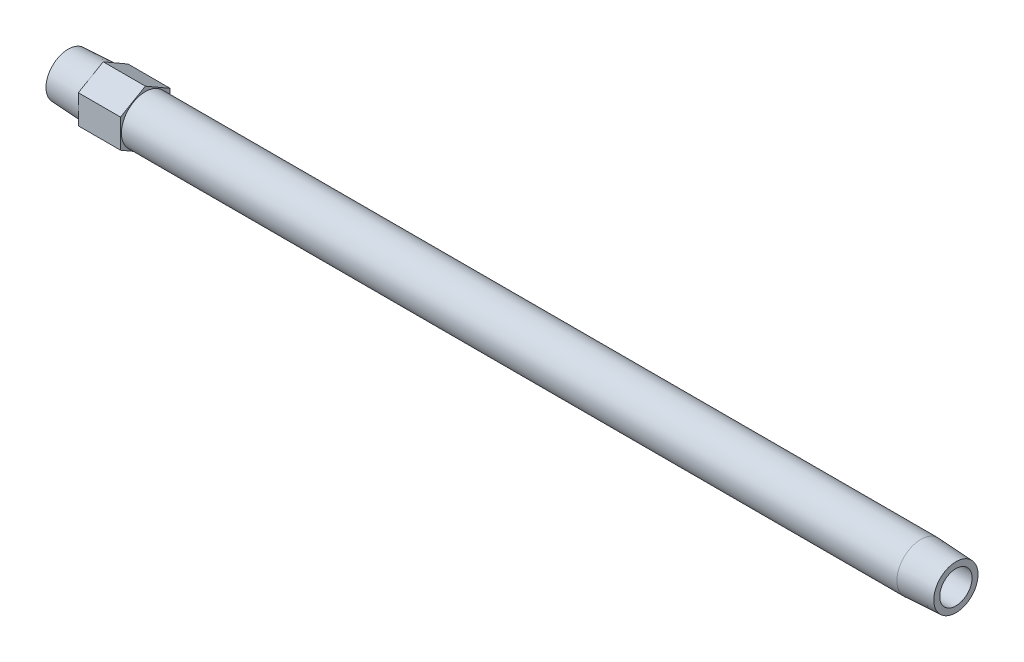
ISO-10303-21;
HEADER;
FILE_DESCRIPTION(('STEP AP214'),'2;1');
FILE_NAME('part.step','',(''),(''),'','','');
FILE_SCHEMA(('AUTOMOTIVE_DESIGN { 1 0 10303 214 1 1 1 1 }'));
ENDSEC;
DATA;
#1=APPLICATION_CONTEXT('core data for automotive mechanical design processes');
#2=APPLICATION_PROTOCOL_DEFINITION('international standard','automotive_design',2000,#1);
#3=PRODUCT_CONTEXT('',#1,'mechanical');
#4=PRODUCT('Part','Part','',(#3));
#5=PRODUCT_RELATED_PRODUCT_CATEGORY('part','',(#4));
#6=PRODUCT_DEFINITION_FORMATION('','',#4);
#7=PRODUCT_DEFINITION_CONTEXT('part definition',#1,'design');
#8=PRODUCT_DEFINITION('design','',#6,#7);
#9=PRODUCT_DEFINITION_SHAPE('','',#8);
#10=(LENGTH_UNIT() NAMED_UNIT(*) SI_UNIT(.MILLI.,.METRE.));
#11=(NAMED_UNIT(*) PLANE_ANGLE_UNIT() SI_UNIT($,.RADIAN.));
#12=(NAMED_UNIT(*) SI_UNIT($,.STERADIAN.) SOLID_ANGLE_UNIT());
#13=UNCERTAINTY_MEASURE_WITH_UNIT(LENGTH_MEASURE(1.E-05),#10,'distance_accuracy_value','');
#14=(GEOMETRIC_REPRESENTATION_CONTEXT(3) GLOBAL_UNCERTAINTY_ASSIGNED_CONTEXT((#13)) GLOBAL_UNIT_ASSIGNED_CONTEXT((#10,
#11,#12)) REPRESENTATION_CONTEXT('',''));
#15=CARTESIAN_POINT('',(0.,0.,0.));
#16=DIRECTION('',(0.,0.,1.));
#17=DIRECTION('',(1.,0.,0.));
#18=AXIS2_PLACEMENT_3D('',#15,#16,#17);
#19=CARTESIAN_POINT('',(0.,0.,-6.3321927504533));
#20=DIRECTION('',(1.,0.,0.));
#21=DIRECTION('',(0.,0.,-1.));
#22=AXIS2_PLACEMENT_3D('',#19,#20,#21);
#23=PLANE('',#22);
#24=CARTESIAN_POINT('',(0.,0.,0.));
#25=DIRECTION('',(-1.,0.,0.));
#26=DIRECTION('',(0.,0.,1.));
#27=AXIS2_PLACEMENT_3D('',#24,#25,#26);
#28=CIRCLE('',#27,6.3321927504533);
#29=CARTESIAN_POINT('',(0.,0.,6.3321927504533));
#30=VERTEX_POINT('',#29);
#31=EDGE_CURVE('E147',#30,#30,#28,.T.);
#32=ORIENTED_EDGE('',*,*,#31,.T.);
#33=EDGE_LOOP('',(#32));
#34=FACE_BOUND('',#33,.T.);
#35=CARTESIAN_POINT('',(0.,0.,0.));
#36=DIRECTION('',(1.,0.,0.));
#37=DIRECTION('',(0.,0.,1.));
#38=AXIS2_PLACEMENT_3D('',#35,#36,#37);
#39=CIRCLE('',#38,4.6228);
#40=CARTESIAN_POINT('',(0.,0.,4.6228));
#41=VERTEX_POINT('',#40);
#42=EDGE_CURVE('E159',#41,#41,#39,.T.);
#43=ORIENTED_EDGE('',*,*,#42,.T.);
#44=EDGE_LOOP('',(#43));
#45=FACE_BOUND('',#44,.T.);
#46=ADVANCED_FACE('F15',(#34,#45),#23,.F.);
#47=CARTESIAN_POINT('',(254.,0.,-6.33219275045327));
#48=DIRECTION('',(-1.,0.,0.));
#49=DIRECTION('',(0.,0.,1.));
#50=AXIS2_PLACEMENT_3D('',#47,#48,#49);
#51=PLANE('',#50);
#52=CARTESIAN_POINT('',(254.,0.,0.));
#53=DIRECTION('',(-1.,0.,0.));
#54=DIRECTION('',(0.,0.,1.));
#55=AXIS2_PLACEMENT_3D('',#52,#53,#54);
#56=CIRCLE('',#55,6.33219275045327);
#57=CARTESIAN_POINT('',(254.,0.,6.33219275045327));
#58=VERTEX_POINT('',#57);
#59=EDGE_CURVE('E150',#58,#58,#56,.T.);
#60=ORIENTED_EDGE('',*,*,#59,.F.);
#61=EDGE_LOOP('',(#60));
#62=FACE_BOUND('',#61,.T.);
#63=CARTESIAN_POINT('',(254.,0.,0.));
#64=DIRECTION('',(-1.,0.,0.));
#65=DIRECTION('',(0.,0.,1.));
#66=AXIS2_PLACEMENT_3D('',#63,#64,#65);
#67=CIRCLE('',#66,4.6228);
#68=CARTESIAN_POINT('',(254.,0.,4.6228));
#69=VERTEX_POINT('',#68);
#70=EDGE_CURVE('E156',#69,#69,#67,.F.);
#71=ORIENTED_EDGE('',*,*,#70,.F.);
#72=EDGE_LOOP('',(#71));
#73=FACE_BOUND('',#72,.T.);
#74=ADVANCED_FACE('F178',(#62,#73),#51,.F.);
#75=CARTESIAN_POINT('',(22.098,-12.3183453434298,7.112));
#76=DIRECTION('',(-1.,0.,0.));
#77=DIRECTION('',(0.,-1.,0.));
#78=AXIS2_PLACEMENT_3D('',#75,#76,#77);
#79=PLANE('',#78);
#80=DIRECTION('',(0.,0.5,-0.866025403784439));
#81=VECTOR('',#80,1.);
#82=CARTESIAN_POINT('',(22.098,-8.21223022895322,0.));
#83=LINE('',#82,#81);
#84=CARTESIAN_POINT('',(22.098,-8.21223022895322,0.));
#85=VERTEX_POINT('',#84);
#86=CARTESIAN_POINT('',(22.098,-4.10611511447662,-7.112));
#87=VERTEX_POINT('',#86);
#88=EDGE_CURVE('E103',#85,#87,#83,.T.);
#89=ORIENTED_EDGE('',*,*,#88,.T.);
#90=DIRECTION('',(0.,1.,0.));
#91=VECTOR('',#90,1.);
#92=CARTESIAN_POINT('',(22.098,-4.10611511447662,-7.112));
#93=LINE('',#92,#91);
#94=CARTESIAN_POINT('',(22.098,4.10611511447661,-7.112));
#95=VERTEX_POINT('',#94);
#96=EDGE_CURVE('E83',#87,#95,#93,.T.);
#97=ORIENTED_EDGE('',*,*,#96,.T.);
#98=DIRECTION('',(0.,0.5,0.866025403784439));
#99=VECTOR('',#98,1.);
#100=CARTESIAN_POINT('',(22.098,4.10611511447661,-7.112));
#101=LINE('',#100,#99);
#102=CARTESIAN_POINT('',(22.098,8.21223022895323,0.));
#103=VERTEX_POINT('',#102);
#104=EDGE_CURVE('E102',#95,#103,#101,.T.);
#105=ORIENTED_EDGE('',*,*,#104,.T.);
#106=DIRECTION('',(0.,-0.5,0.866025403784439));
#107=VECTOR('',#106,1.);
#108=CARTESIAN_POINT('',(22.098,8.21223022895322,0.));
#109=LINE('',#108,#107);
#110=CARTESIAN_POINT('',(22.098,4.10611511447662,7.112));
#111=VERTEX_POINT('',#110);
#112=EDGE_CURVE('E105',#103,#111,#109,.T.);
#113=ORIENTED_EDGE('',*,*,#112,.T.);
#114=DIRECTION('',(0.,-1.,0.));
#115=VECTOR('',#114,1.);
#116=CARTESIAN_POINT('',(22.098,4.10611511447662,7.112));
#117=LINE('',#116,#115);
#118=CARTESIAN_POINT('',(22.098,-4.10611511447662,7.112));
#119=VERTEX_POINT('',#118);
#120=EDGE_CURVE('E35',#111,#119,#117,.T.);
#121=ORIENTED_EDGE('',*,*,#120,.T.);
#122=DIRECTION('',(0.,-0.5,-0.866025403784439));
#123=VECTOR('',#122,1.);
#124=CARTESIAN_POINT('',(22.098,-4.10611511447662,7.112));
#125=LINE('',#124,#123);
#126=EDGE_CURVE('E30',#119,#85,#125,.T.);
#127=ORIENTED_EDGE('',*,*,#126,.T.);
#128=EDGE_LOOP('',(#89,#97,#105,#113,#121,#127));
#129=FACE_BOUND('',#128,.T.);
#130=CARTESIAN_POINT('',(22.098,0.,0.));
#131=DIRECTION('',(-1.,0.,0.));
#132=DIRECTION('',(0.,-1.,0.));
#133=AXIS2_PLACEMENT_3D('',#130,#131,#132);
#134=CIRCLE('',#133,6.858);
#135=CARTESIAN_POINT('',(22.098,-6.858,0.));
#136=VERTEX_POINT('',#135);
#137=EDGE_CURVE('E89',#136,#136,#134,.F.);
#138=ORIENTED_EDGE('',*,*,#137,.F.);
#139=EDGE_LOOP('',(#138));
#140=FACE_BOUND('',#139,.T.);
#141=ADVANCED_FACE('F124',(#129,#140),#79,.F.);
#142=CARTESIAN_POINT('',(10.033,-12.3183453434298,7.112));
#143=DIRECTION('',(-1.,0.,0.));
#144=DIRECTION('',(0.,-1.,0.));
#145=AXIS2_PLACEMENT_3D('',#142,#143,#144);
#146=PLANE('',#145);
#147=DIRECTION('',(0.,0.5,-0.866025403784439));
#148=VECTOR('',#147,1.);
#149=CARTESIAN_POINT('',(10.033,-8.21223022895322,0.));
#150=LINE('',#149,#148);
#151=CARTESIAN_POINT('',(10.033,-8.21223022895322,0.));
#152=VERTEX_POINT('',#151);
#153=CARTESIAN_POINT('',(10.033,-4.10611511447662,-7.112));
#154=VERTEX_POINT('',#153);
#155=EDGE_CURVE('E73',#152,#154,#150,.T.);
#156=ORIENTED_EDGE('',*,*,#155,.F.);
#157=DIRECTION('',(0.,-0.5,-0.866025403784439));
#158=VECTOR('',#157,1.);
#159=CARTESIAN_POINT('',(10.033,-4.10611511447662,7.112));
#160=LINE('',#159,#158);
#161=CARTESIAN_POINT('',(10.033,-4.10611511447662,7.112));
#162=VERTEX_POINT('',#161);
#163=EDGE_CURVE('E99',#162,#152,#160,.T.);
#164=ORIENTED_EDGE('',*,*,#163,.F.);
#165=DIRECTION('',(0.,-1.,0.));
#166=VECTOR('',#165,1.);
#167=CARTESIAN_POINT('',(10.033,4.10611511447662,7.112));
#168=LINE('',#167,#166);
#169=CARTESIAN_POINT('',(10.033,4.10611511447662,7.112));
#170=VERTEX_POINT('',#169);
#171=EDGE_CURVE('E133',#170,#162,#168,.T.);
#172=ORIENTED_EDGE('',*,*,#171,.F.);
#173=DIRECTION('',(0.,-0.5,0.866025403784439));
#174=VECTOR('',#173,1.);
#175=CARTESIAN_POINT('',(10.033,8.21223022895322,0.));
#176=LINE('',#175,#174);
#177=CARTESIAN_POINT('',(10.033,8.21223022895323,0.));
#178=VERTEX_POINT('',#177);
#179=EDGE_CURVE('E129',#178,#170,#176,.T.);
#180=ORIENTED_EDGE('',*,*,#179,.F.);
#181=DIRECTION('',(0.,0.5,0.866025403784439));
#182=VECTOR('',#181,1.);
#183=CARTESIAN_POINT('',(10.033,4.10611511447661,-7.112));
#184=LINE('',#183,#182);
#185=CARTESIAN_POINT('',(10.033,4.10611511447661,-7.112));
#186=VERTEX_POINT('',#185);
#187=EDGE_CURVE('E75',#186,#178,#184,.T.);
#188=ORIENTED_EDGE('',*,*,#187,.F.);
#189=DIRECTION('',(0.,1.,0.));
#190=VECTOR('',#189,1.);
#191=CARTESIAN_POINT('',(10.033,-4.10611511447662,-7.112));
#192=LINE('',#191,#190);
#193=EDGE_CURVE('E68',#154,#186,#192,.T.);
#194=ORIENTED_EDGE('',*,*,#193,.F.);
#195=EDGE_LOOP('',(#156,#164,#172,#180,#188,#194));
#196=FACE_BOUND('',#195,.T.);
#197=CARTESIAN_POINT('',(10.033,0.,0.));
#198=DIRECTION('',(-1.,0.,0.));
#199=DIRECTION('',(0.,0.,1.));
#200=AXIS2_PLACEMENT_3D('',#197,#198,#199);
#201=CIRCLE('',#200,6.858);
#202=CARTESIAN_POINT('',(10.033,0.,6.858));
#203=VERTEX_POINT('',#202);
#204=EDGE_CURVE('E95',#203,#203,#201,.T.);
#205=ORIENTED_EDGE('',*,*,#204,.F.);
#206=EDGE_LOOP('',(#205));
#207=FACE_BOUND('',#206,.T.);
#208=ADVANCED_FACE('F69',(#196,#207),#146,.T.);
#209=CARTESIAN_POINT('',(22.098,-8.21223022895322,0.));
#210=DIRECTION('',(0.,0.866025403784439,0.5));
#211=DIRECTION('',(0.,-0.5,0.866025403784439));
#212=AXIS2_PLACEMENT_3D('',#209,#210,#211);
#213=PLANE('',#212);
#214=ORIENTED_EDGE('',*,*,#155,.T.);
#215=DIRECTION('',(-1.,0.,0.));
#216=VECTOR('',#215,1.);
#217=CARTESIAN_POINT('',(22.098,-4.10611511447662,-7.112));
#218=LINE('',#217,#216);
#219=EDGE_CURVE('E10',#87,#154,#218,.T.);
#220=ORIENTED_EDGE('',*,*,#219,.F.);
#221=ORIENTED_EDGE('',*,*,#88,.F.);
#222=DIRECTION('',(-1.,0.,0.));
#223=VECTOR('',#222,1.);
#224=CARTESIAN_POINT('',(22.098,-8.21223022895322,0.));
#225=LINE('',#224,#223);
#226=EDGE_CURVE('E87',#85,#152,#225,.T.);
#227=ORIENTED_EDGE('',*,*,#226,.T.);
#228=EDGE_LOOP('',(#214,#220,#221,#227));
#229=FACE_BOUND('',#228,.T.);
#230=ADVANCED_FACE('F17',(#229),#213,.F.);
#231=CARTESIAN_POINT('',(22.098,-4.10611511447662,-7.112));
#232=DIRECTION('',(0.,0.,1.));
#233=DIRECTION('',(0.,-1.,0.));
#234=AXIS2_PLACEMENT_3D('',#231,#232,#233);
#235=PLANE('',#234);
#236=ORIENTED_EDGE('',*,*,#193,.T.);
#237=DIRECTION('',(-1.,0.,0.));
#238=VECTOR('',#237,1.);
#239=CARTESIAN_POINT('',(22.098,4.10611511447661,-7.112));
#240=LINE('',#239,#238);
#241=EDGE_CURVE('E23',#95,#186,#240,.T.);
#242=ORIENTED_EDGE('',*,*,#241,.F.);
#243=ORIENTED_EDGE('',*,*,#96,.F.);
#244=ORIENTED_EDGE('',*,*,#219,.T.);
#245=EDGE_LOOP('',(#236,#242,#243,#244));
#246=FACE_BOUND('',#245,.T.);
#247=ADVANCED_FACE('F82',(#246),#235,.F.);
#248=CARTESIAN_POINT('',(22.098,4.10611511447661,-7.112));
#249=DIRECTION('',(0.,-0.866025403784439,0.5));
#250=DIRECTION('',(0.,-0.5,-0.866025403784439));
#251=AXIS2_PLACEMENT_3D('',#248,#249,#250);
#252=PLANE('',#251);
#253=ORIENTED_EDGE('',*,*,#187,.T.);
#254=DIRECTION('',(-1.,0.,0.));
#255=VECTOR('',#254,1.);
#256=CARTESIAN_POINT('',(22.098,8.21223022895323,0.));
#257=LINE('',#256,#255);
#258=EDGE_CURVE('E117',#103,#178,#257,.T.);
#259=ORIENTED_EDGE('',*,*,#258,.F.);
#260=ORIENTED_EDGE('',*,*,#104,.F.);
#261=ORIENTED_EDGE('',*,*,#241,.T.);
#262=EDGE_LOOP('',(#253,#259,#260,#261));
#263=FACE_BOUND('',#262,.T.);
#264=ADVANCED_FACE('F121',(#263),#252,.F.);
#265=CARTESIAN_POINT('',(22.098,8.21223022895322,0.));
#266=DIRECTION('',(0.,-0.866025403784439,-0.5));
#267=DIRECTION('',(0.,0.5,-0.866025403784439));
#268=AXIS2_PLACEMENT_3D('',#265,#266,#267);
#269=PLANE('',#268);
#270=ORIENTED_EDGE('',*,*,#179,.T.);
#271=DIRECTION('',(-1.,0.,0.));
#272=VECTOR('',#271,1.);
#273=CARTESIAN_POINT('',(22.098,4.10611511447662,7.112));
#274=LINE('',#273,#272);
#275=EDGE_CURVE('E114',#111,#170,#274,.T.);
#276=ORIENTED_EDGE('',*,*,#275,.F.);
#277=ORIENTED_EDGE('',*,*,#112,.F.);
#278=ORIENTED_EDGE('',*,*,#258,.T.);
#279=EDGE_LOOP('',(#270,#276,#277,#278));
#280=FACE_BOUND('',#279,.T.);
#281=ADVANCED_FACE('F128',(#280),#269,.F.);
#282=CARTESIAN_POINT('',(22.098,4.10611511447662,7.112));
#283=DIRECTION('',(0.,0.,-1.));
#284=DIRECTION('',(-1.,0.,0.));
#285=AXIS2_PLACEMENT_3D('',#282,#283,#284);
#286=PLANE('',#285);
#287=ORIENTED_EDGE('',*,*,#171,.T.);
#288=DIRECTION('',(-1.,0.,0.));
#289=VECTOR('',#288,1.);
#290=CARTESIAN_POINT('',(22.098,-4.10611511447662,7.112));
#291=LINE('',#290,#289);
#292=EDGE_CURVE('E111',#119,#162,#291,.T.);
#293=ORIENTED_EDGE('',*,*,#292,.F.);
#294=ORIENTED_EDGE('',*,*,#120,.F.);
#295=ORIENTED_EDGE('',*,*,#275,.T.);
#296=EDGE_LOOP('',(#287,#293,#294,#295));
#297=FACE_BOUND('',#296,.T.);
#298=ADVANCED_FACE('F132',(#297),#286,.F.);
#299=CARTESIAN_POINT('',(22.098,-4.10611511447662,7.112));
#300=DIRECTION('',(0.,0.866025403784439,-0.5));
#301=DIRECTION('',(0.,0.5,0.866025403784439));
#302=AXIS2_PLACEMENT_3D('',#299,#300,#301);
#303=PLANE('',#302);
#304=ORIENTED_EDGE('',*,*,#163,.T.);
#305=ORIENTED_EDGE('',*,*,#226,.F.);
#306=ORIENTED_EDGE('',*,*,#126,.F.);
#307=ORIENTED_EDGE('',*,*,#292,.T.);
#308=EDGE_LOOP('',(#304,#305,#306,#307));
#309=FACE_BOUND('',#308,.T.);
#310=ADVANCED_FACE('F135',(#309),#303,.F.);
#311=CARTESIAN_POINT('',(10.033,0.,0.));
#312=DIRECTION('',(1.,0.,0.));
#313=DIRECTION('',(0.,0.,-1.));
#314=AXIS2_PLACEMENT_3D('',#311,#312,#313);
#315=CONICAL_SURFACE('',#314,6.858,0.0523598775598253);
#316=ORIENTED_EDGE('',*,*,#31,.F.);
#317=EDGE_LOOP('',(#316));
#318=FACE_BOUND('',#317,.T.);
#319=ORIENTED_EDGE('',*,*,#204,.T.);
#320=EDGE_LOOP('',(#319));
#321=FACE_BOUND('',#320,.T.);
#322=ADVANCED_FACE('F187',(#318,#321),#315,.T.);
#323=CARTESIAN_POINT('',(-60.,0.,0.));
#324=DIRECTION('',(-1.,0.,0.));
#325=DIRECTION('',(0.,0.,1.));
#326=AXIS2_PLACEMENT_3D('',#323,#324,#325);
#327=CYLINDRICAL_SURFACE('',#326,6.858);
#328=ORIENTED_EDGE('',*,*,#137,.T.);
#329=EDGE_LOOP('',(#328));
#330=FACE_BOUND('',#329,.T.);
#331=CARTESIAN_POINT('',(243.967,0.,0.));
#332=DIRECTION('',(-1.,0.,0.));
#333=DIRECTION('',(0.,0.,1.));
#334=AXIS2_PLACEMENT_3D('',#331,#332,#333);
#335=CIRCLE('',#334,6.858);
#336=CARTESIAN_POINT('',(243.967,0.,6.858));
#337=VERTEX_POINT('',#336);
#338=EDGE_CURVE('E153',#337,#337,#335,.T.);
#339=ORIENTED_EDGE('',*,*,#338,.T.);
#340=EDGE_LOOP('',(#339));
#341=FACE_BOUND('',#340,.T.);
#342=ADVANCED_FACE('F174',(#330,#341),#327,.T.);
#343=CARTESIAN_POINT('',(254.,0.,0.));
#344=DIRECTION('',(-1.,0.,0.));
#345=DIRECTION('',(0.,0.,1.));
#346=AXIS2_PLACEMENT_3D('',#343,#344,#345);
#347=CONICAL_SURFACE('',#346,6.33219275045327,0.052359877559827);
#348=ORIENTED_EDGE('',*,*,#338,.F.);
#349=EDGE_LOOP('',(#348));
#350=FACE_BOUND('',#349,.T.);
#351=ORIENTED_EDGE('',*,*,#59,.T.);
#352=EDGE_LOOP('',(#351));
#353=FACE_BOUND('',#352,.T.);
#354=ADVANCED_FACE('F167',(#350,#353),#347,.T.);
#355=CARTESIAN_POINT('',(254.927607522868,0.,0.));
#356=DIRECTION('',(-1.,0.,0.));
#357=DIRECTION('',(0.,0.,1.));
#358=AXIS2_PLACEMENT_3D('',#355,#356,#357);
#359=CYLINDRICAL_SURFACE('',#358,4.6228);
#360=ORIENTED_EDGE('',*,*,#70,.T.);
#361=EDGE_LOOP('',(#360));
#362=FACE_BOUND('',#361,.T.);
#363=ORIENTED_EDGE('',*,*,#42,.F.);
#364=EDGE_LOOP('',(#363));
#365=FACE_BOUND('',#364,.T.);
#366=ADVANCED_FACE('F165',(#362,#365),#359,.F.);
#367=CLOSED_SHELL('',(#46,#74,#141,#208,#230,#247,#264,#281,#298,#310,#322,#342,#354,#366));
#368=MANIFOLD_SOLID_BREP('B1',#367);
#369=ADVANCED_BREP_SHAPE_REPRESENTATION('',(#18,#368),#14);
#370=SHAPE_DEFINITION_REPRESENTATION(#9,#369);
ENDSEC;
END-ISO-10303-21;
